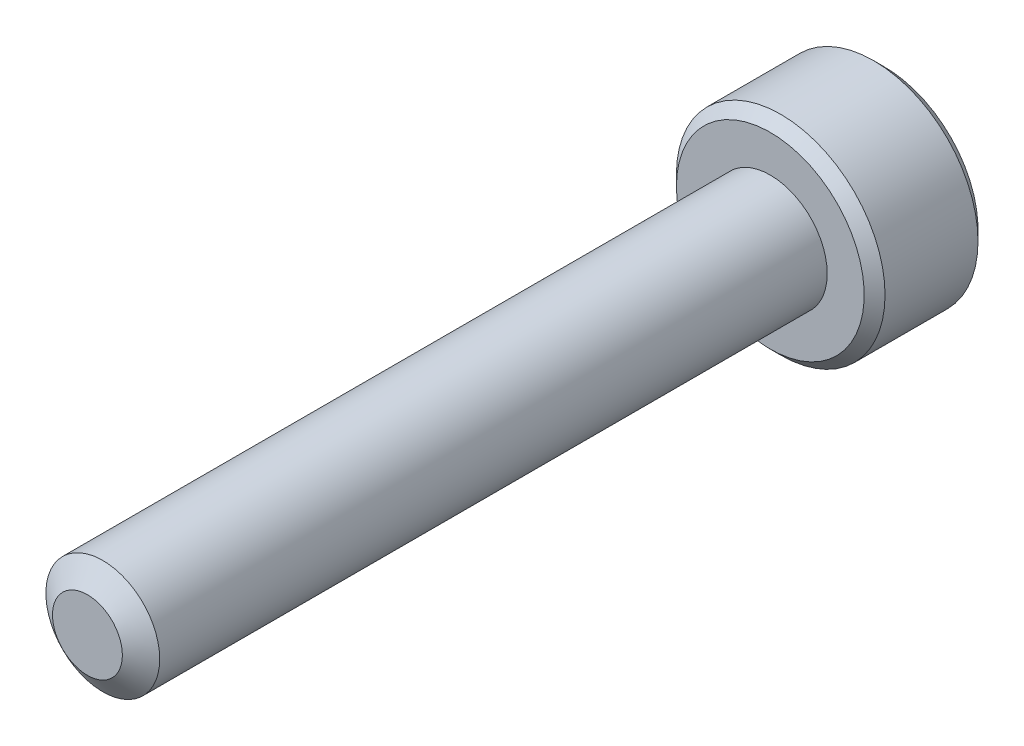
from build123d import *

# Parameters (mm, degrees)
SKETCH1_R          = 1.5
EXTRUDE1_DEPTH     = 18
SKETCH6_R          = 2.75
EXTRUDE2_DEPTH     = 3
CUT_EXTRUDE1_DEPTH = 1.875
CHAMFER1_SIZE      = 0.275


with BuildPart() as part:
    # Sketch1 → Extrude1 (new body)
    with BuildSketch(Plane.XY):
        Circle(SKETCH1_R)
    extrude(amount=-EXTRUDE1_DEPTH)

    # Sketch4 → Cut-Revolve1 (revolve, cut)
    with BuildSketch(Plane(origin=(0, 0, 0), x_dir=(0, 0, -1), z_dir=(1, 0, 0)), mode=Mode.PRIVATE) as cut_revolve1_sk:
        Polygon((0.405251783, 1.5), (0, 0.921240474), (0, 1.5), align=None)
    revolve(cut_revolve1_sk.sketch.rotate(Axis((0, 0, 0), (0, 0, -1)), 90), axis=Axis((0, 0, 0), (0, 0, -1)), mode=Mode.SUBTRACT)

    # Sketch6 → Extrude2 (add)
    with BuildSketch(Plane(origin=(0, 0, -18), x_dir=(-1, 0, 0), z_dir=(0, 0, -1))):
        Circle(SKETCH6_R)
    extrude(amount=EXTRUDE2_DEPTH)

    # Sketch7 → Cut-Extrude1 (cut)
    with BuildSketch(Plane(origin=(0, 0, -21), x_dir=(-1, 0, 0), z_dir=(0, 0, -1))):
        Polygon((0, 1.443375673), (-1.25, 0.721687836), (-1.25, -0.721687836), (0, -1.443375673), (1.25, -0.721687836), (1.25, 0.721687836), align=None)
    extrude(amount=-CUT_EXTRUDE1_DEPTH, mode=Mode.SUBTRACT)

    # Cut-Extrude2 cone 1 section (on through the dimple's axis) → Cut-Extrude2 (revolve, cut)
    with BuildSketch(Plane(origin=(0, 0, -21), x_dir=(0, 1, 0), z_dir=(1, 0, 0))):
        Polygon((0, 0), (1.443375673, 0), (0, 1.443375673), align=None)
    revolve(axis=Axis((0, 0, -21), (0, 0, 1)), mode=Mode.SUBTRACT)

    # Chamfer1
    chamfer1_edges = [part.edges().sort_by_distance(p)[0] for p in [
        (2.75, 0, -18),
        (2.75, 0, -21),
    ]]
    chamfer(chamfer1_edges, length=CHAMFER1_SIZE)


solid = part.part
